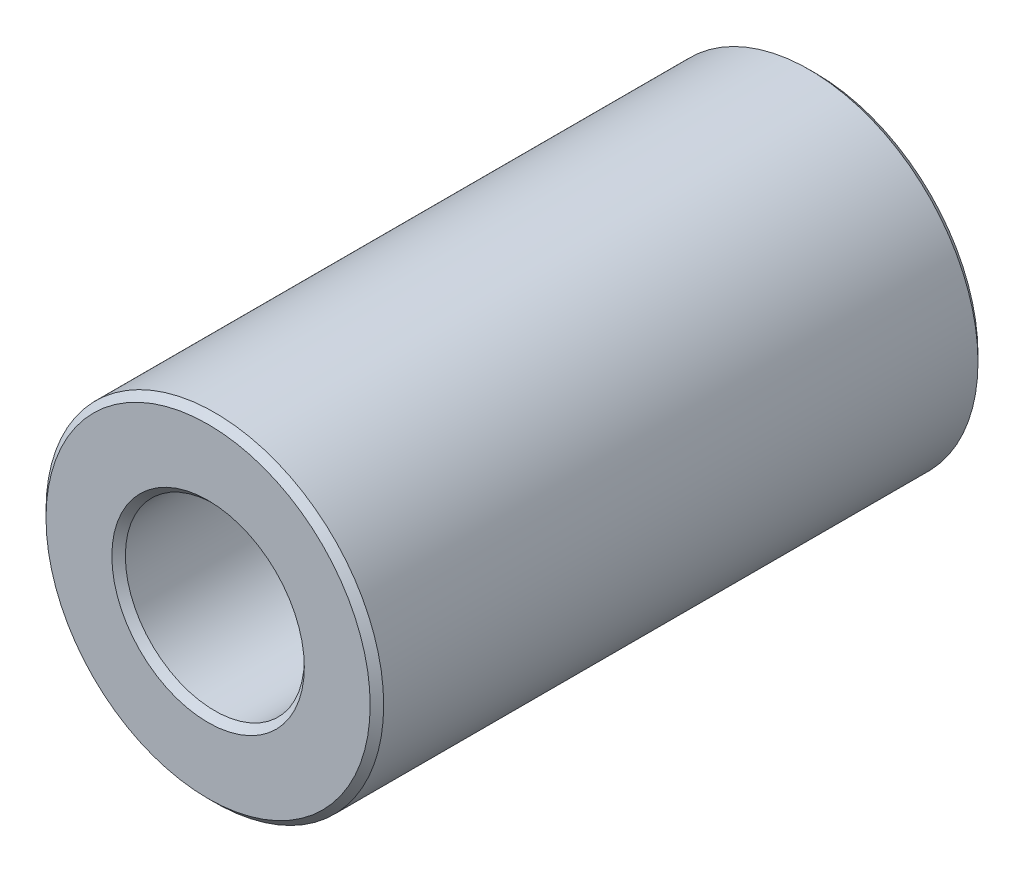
from build123d import *

# Parameters (mm, degrees)
SKETCH1_R           = 5
SKETCH1_R_2         = 2.65
BOSS_EXTRUDE2_DEPTH = 9
CHAMFER3_SIZE       = 0.2


with BuildPart() as part:
    # Sketch1 → Boss-Extrude2 (new, symmetric)
    with BuildSketch(Plane.XY):
        Circle(SKETCH1_R)
        Circle(SKETCH1_R_2, mode=Mode.SUBTRACT)
    extrude(amount=BOSS_EXTRUDE2_DEPTH, both=True)

    # Chamfer3
    chamfer3_edges = [part.edges().sort_by_distance(p)[0] for p in [
        (-5, 0, -9),
        (-5, 0, 9),
        (-2.65, 0, -9),
        (-2.65, 0, 9),
    ]]
    chamfer(chamfer3_edges, length=CHAMFER3_SIZE)


solid = part.part
